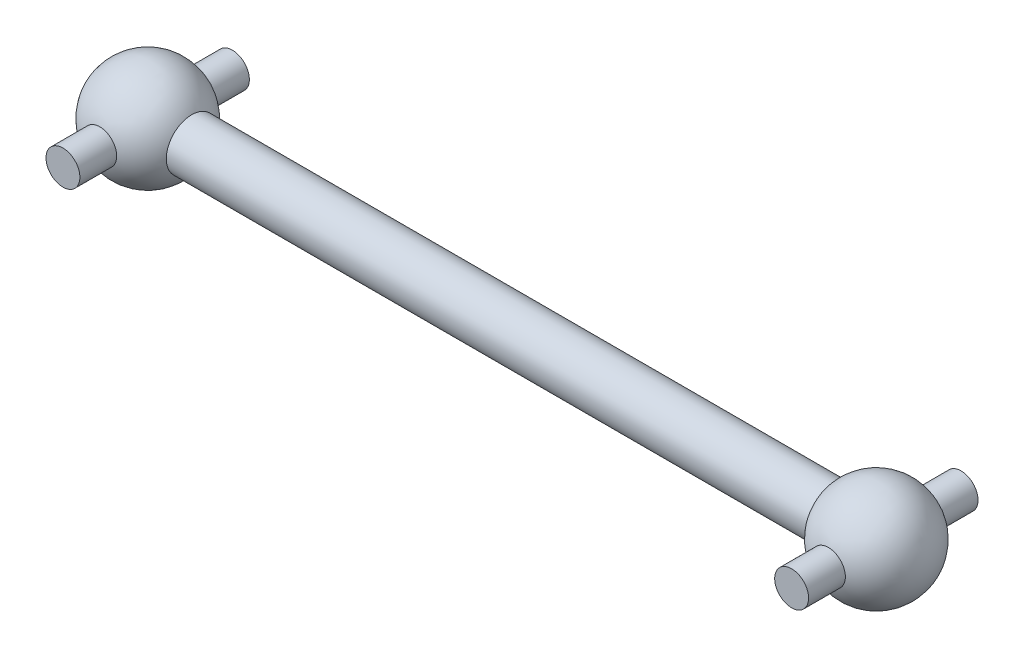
from build123d import *

# Parameters (mm, degrees)
ESQUISSE2_R        = 1
BOSS_EXTRU_1_DEPTH = 5


with BuildPart() as part:
    # Esquisse1 → Base-R_volution (revolve)
    with BuildSketch(Plane.XY):
        with BuildLine():
            Line((-18.901923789, 1.5), (18.901923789, 1.5))
            ThreePointArc((18.901923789, 1.5), (22.276457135, 2.897777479), (24.5, 0))
            Line((24.5, 0), (-24.5, 0))
            ThreePointArc((-24.5, 0), (-22.276457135, 2.897777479), (-18.901923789, 1.5))
        make_face()
    revolve(axis=Axis((-25.705096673, 0, 0), (1, 0, 0)))

    # Esquisse2 → Boss.-Extru.1 (add, symmetric)
    with BuildSketch(Plane.XY):
        with Locations(Location((-21.5, 0, 0), (0, 0, 180))):
            Circle(ESQUISSE2_R)
        with Locations(Location((21.5, 0, 0), (0, 0, 180))):
            Circle(ESQUISSE2_R)
    extrude(amount=BOSS_EXTRU_1_DEPTH, both=True)


solid = part.part
